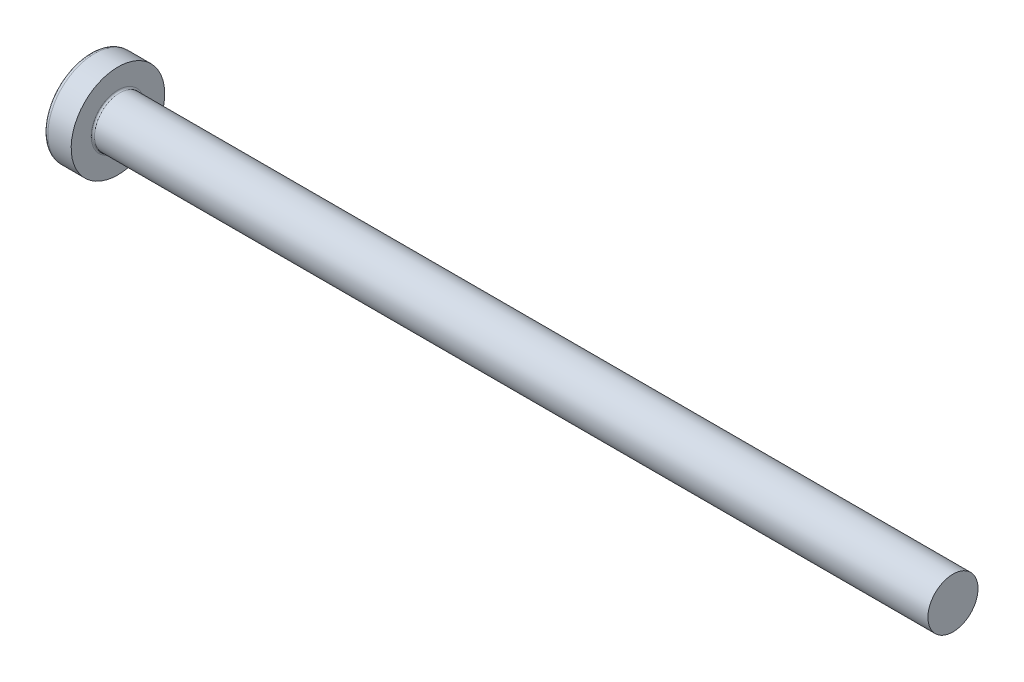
ISO-10303-21;
HEADER;
FILE_DESCRIPTION(('STEP AP214'),'2;1');
FILE_NAME('part.step','',(''),(''),'','','');
FILE_SCHEMA(('AUTOMOTIVE_DESIGN { 1 0 10303 214 1 1 1 1 }'));
ENDSEC;
DATA;
#1=APPLICATION_CONTEXT('core data for automotive mechanical design processes');
#2=APPLICATION_PROTOCOL_DEFINITION('international standard','automotive_design',2000,#1);
#3=PRODUCT_CONTEXT('',#1,'mechanical');
#4=PRODUCT('Part','Part','',(#3));
#5=PRODUCT_RELATED_PRODUCT_CATEGORY('part','',(#4));
#6=PRODUCT_DEFINITION_FORMATION('','',#4);
#7=PRODUCT_DEFINITION_CONTEXT('part definition',#1,'design');
#8=PRODUCT_DEFINITION('design','',#6,#7);
#9=PRODUCT_DEFINITION_SHAPE('','',#8);
#10=(LENGTH_UNIT() NAMED_UNIT(*) SI_UNIT(.MILLI.,.METRE.));
#11=(NAMED_UNIT(*) PLANE_ANGLE_UNIT() SI_UNIT($,.RADIAN.));
#12=(NAMED_UNIT(*) SI_UNIT($,.STERADIAN.) SOLID_ANGLE_UNIT());
#13=UNCERTAINTY_MEASURE_WITH_UNIT(LENGTH_MEASURE(1.E-05),#10,'distance_accuracy_value','');
#14=(GEOMETRIC_REPRESENTATION_CONTEXT(3) GLOBAL_UNCERTAINTY_ASSIGNED_CONTEXT((#13)) GLOBAL_UNIT_ASSIGNED_CONTEXT((#10,
#11,#12)) REPRESENTATION_CONTEXT('',''));
#15=CARTESIAN_POINT('',(0.,0.,0.));
#16=DIRECTION('',(0.,0.,1.));
#17=DIRECTION('',(1.,0.,0.));
#18=AXIS2_PLACEMENT_3D('',#15,#16,#17);
#19=CARTESIAN_POINT('',(1.75,0.527482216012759,-0.369999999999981));
#20=DIRECTION('',(0.,0.,1.));
#21=DIRECTION('',(1.,0.,0.));
#22=AXIS2_PLACEMENT_3D('',#19,#20,#21);
#23=PLANE('',#22);
#24=DIRECTION('',(0.,1.,0.));
#25=VECTOR('',#24,1.);
#26=CARTESIAN_POINT('',(1.75,0.527482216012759,-0.369999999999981));
#27=LINE('',#26,#25);
#28=CARTESIAN_POINT('',(1.75000000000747,0.415013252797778,-0.369999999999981));
#29=VERTEX_POINT('',#28);
#30=CARTESIAN_POINT('',(1.74999999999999,0.527482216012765,-0.369999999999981));
#31=VERTEX_POINT('',#30);
#32=EDGE_CURVE('E186',#29,#31,#27,.T.);
#33=ORIENTED_EDGE('',*,*,#32,.T.);
#34=DIRECTION('',(-0.89493436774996,0.446197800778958,0.));
#35=VECTOR('',#34,1.);
#36=CARTESIAN_POINT('',(1.75,0.527482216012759,-0.369999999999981));
#37=LINE('',#36,#35);
#38=CARTESIAN_POINT('',(0.187869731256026,1.30633161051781,-0.369999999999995));
#39=VERTEX_POINT('',#38);
#40=EDGE_CURVE('E169',#31,#39,#37,.T.);
#41=ORIENTED_EDGE('',*,*,#40,.T.);
#42=CARTESIAN_POINT('',(0.18786973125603,1.30633161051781,-0.369999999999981));
#43=CARTESIAN_POINT('',(0.154819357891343,1.18453176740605,-0.369999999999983));
#44=CARTESIAN_POINT('',(0.126454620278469,1.06183422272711,-0.369999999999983));
#45=CARTESIAN_POINT('',(0.0790964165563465,0.814643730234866,-0.36999999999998));
#46=CARTESIAN_POINT('',(0.0601029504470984,0.690150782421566,-0.369999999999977));
#47=CARTESIAN_POINT('',(0.0457951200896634,0.564760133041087,-0.369999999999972));
#48=B_SPLINE_CURVE_WITH_KNOTS('',3,(#42,#43,#44,#45,#46,#47),.UNSPECIFIED.,.F.,.F.,(4,2,4),(0.,
0.377800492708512,0.755600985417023),.UNSPECIFIED.);
#49=CARTESIAN_POINT('',(0.0457951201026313,0.564760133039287,-0.369999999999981));
#50=VERTEX_POINT('',#49);
#51=EDGE_CURVE('E178',#39,#50,#48,.T.);
#52=ORIENTED_EDGE('',*,*,#51,.T.);
#53=CARTESIAN_POINT('',(0.0457951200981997,0.564760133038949,-0.369999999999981));
#54=CARTESIAN_POINT('',(0.255445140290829,0.547215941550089,-0.369999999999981));
#55=CARTESIAN_POINT('',(0.465078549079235,0.529461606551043,-0.369999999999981));
#56=CARTESIAN_POINT('',(0.88428586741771,0.493290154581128,-0.369999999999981));
#57=CARTESIAN_POINT('',(1.09385977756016,0.474873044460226,-0.369999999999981));
#58=CARTESIAN_POINT('',(1.37783894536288,0.449298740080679,-0.369999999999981));
#59=CARTESIAN_POINT('',(1.45227978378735,0.442537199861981,-0.369999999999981));
#60=CARTESIAN_POINT('',(1.60114945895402,0.428880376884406,-0.369999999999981));
#61=CARTESIAN_POINT('',(1.67557829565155,0.421985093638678,-0.369999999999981));
#62=CARTESIAN_POINT('',(1.75000000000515,0.415013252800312,-0.369999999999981));
#63=B_SPLINE_CURVE_WITH_KNOTS('',3,(#53,#54,#55,#56,#57,#58,#59,#60,#61,#62),.UNSPECIFIED.,.F.,
.F.,(4,2,2,2,4),(0.,0.631149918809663,1.26229331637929,1.48653506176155,1.7107776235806),.UNSPECIFIED.);
#64=EDGE_CURVE('E536',#50,#29,#63,.T.);
#65=ORIENTED_EDGE('',*,*,#64,.T.);
#66=EDGE_LOOP('',(#33,#41,#52,#65));
#67=FACE_BOUND('',#66,.T.);
#68=ADVANCED_FACE('F17',(#67),#23,.T.);
#69=CARTESIAN_POINT('',(1.75,0.527482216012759,0.370000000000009));
#70=DIRECTION('',(0.446197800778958,0.89493436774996,0.));
#71=DIRECTION('',(-0.89493436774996,0.446197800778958,0.));
#72=AXIS2_PLACEMENT_3D('',#69,#70,#71);
#73=PLANE('',#72);
#74=DIRECTION('',(0.,0.,1.));
#75=VECTOR('',#74,1.);
#76=CARTESIAN_POINT('',(1.75,0.527482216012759,0.370000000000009));
#77=LINE('',#76,#75);
#78=CARTESIAN_POINT('',(1.75,0.527482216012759,0.370000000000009));
#79=VERTEX_POINT('',#78);
#80=CARTESIAN_POINT('',(1.74999999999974,0.527482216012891,0.175779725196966));
#81=VERTEX_POINT('',#80);
#82=EDGE_CURVE('E174',#79,#81,#77,.F.);
#83=ORIENTED_EDGE('',*,*,#82,.F.);
#84=DIRECTION('',(0.894934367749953,-0.446197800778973,0.));
#85=VECTOR('',#84,1.);
#86=CARTESIAN_POINT('',(0.187869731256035,1.30633161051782,0.370000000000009));
#87=LINE('',#86,#85);
#88=CARTESIAN_POINT('',(0.187869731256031,1.30633161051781,0.370000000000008));
#89=VERTEX_POINT('',#88);
#90=EDGE_CURVE('E171',#89,#79,#87,.T.);
#91=ORIENTED_EDGE('',*,*,#90,.F.);
#92=CARTESIAN_POINT('',(0.187869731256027,1.3063316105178,-0.370000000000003));
#93=CARTESIAN_POINT('',(0.179529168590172,1.31049006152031,-0.246666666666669));
#94=CARTESIAN_POINT('',(0.175358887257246,1.31256928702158,-0.123333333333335));
#95=CARTESIAN_POINT('',(0.175358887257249,1.31256928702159,0.123333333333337));
#96=CARTESIAN_POINT('',(0.179529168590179,1.31049006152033,0.246666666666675));
#97=CARTESIAN_POINT('',(0.187869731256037,1.30633161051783,0.370000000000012));
#98=B_SPLINE_CURVE_WITH_KNOTS('',3,(#92,#93,#94,#95,#96,#97),.UNSPECIFIED.,.F.,.F.,(4,2,4),(0.,
0.370264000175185,0.74052800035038),.UNSPECIFIED.);
#99=EDGE_CURVE('E163',#39,#89,#98,.T.);
#100=ORIENTED_EDGE('',*,*,#99,.F.);
#101=ORIENTED_EDGE('',*,*,#40,.F.);
#102=DIRECTION('',(0.,0.,1.));
#103=VECTOR('',#102,1.);
#104=CARTESIAN_POINT('',(1.74999999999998,0.527482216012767,0.370000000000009));
#105=LINE('',#104,#103);
#106=CARTESIAN_POINT('',(1.74999999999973,0.527482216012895,-0.175779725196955));
#107=VERTEX_POINT('',#106);
#108=EDGE_CURVE('E189',#107,#31,#105,.F.);
#109=ORIENTED_EDGE('',*,*,#108,.F.);
#110=CARTESIAN_POINT('',(2.66965234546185,0.0689604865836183,0.));
#111=DIRECTION('',(0.446197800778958,0.89493436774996,0.));
#112=DIRECTION('',(-0.89493436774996,0.446197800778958,0.));
#113=AXIS2_PLACEMENT_3D('',#110,#111,#112);
#114=ELLIPSE('',#113,1.10195891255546,0.486831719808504);
#115=EDGE_CURVE('E537',#81,#107,#114,.F.);
#116=ORIENTED_EDGE('',*,*,#115,.F.);
#117=EDGE_LOOP('',(#83,#91,#100,#101,#109,#116));
#118=FACE_BOUND('',#117,.T.);
#119=ADVANCED_FACE('F166',(#118),#73,.F.);
#120=CARTESIAN_POINT('',(0.0457951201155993,0.,0.));
#121=DIRECTION('',(-1.,0.,0.));
#122=DIRECTION('',(0.,-1.,0.));
#123=AXIS2_PLACEMENT_3D('',#120,#121,#122);
#124=CONICAL_SURFACE('',#123,0.675169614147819,0.0698131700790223);
#125=CARTESIAN_POINT('',(1.75000000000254,0.370000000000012,-0.415013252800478));
#126=CARTESIAN_POINT('',(1.57750313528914,0.370000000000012,-0.431158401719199));
#127=CARTESIAN_POINT('',(1.40497097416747,0.370000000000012,-0.446919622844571));
#128=CARTESIAN_POINT('',(1.05985338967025,0.370000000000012,-0.477835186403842));
#129=CARTESIAN_POINT('',(0.887267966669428,0.370000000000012,-0.492989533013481));
#130=CARTESIAN_POINT('',(0.603200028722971,0.370000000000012,-0.517563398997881));
#131=CARTESIAN_POINT('',(0.491728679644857,0.370000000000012,-0.527112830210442));
#132=CARTESIAN_POINT('',(0.268771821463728,0.370000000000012,-0.546050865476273));
#133=CARTESIAN_POINT('',(0.157286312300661,0.370000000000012,-0.555439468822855));
#134=CARTESIAN_POINT('',(0.0457951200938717,0.370000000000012,-0.564760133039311));
#135=B_SPLINE_CURVE_WITH_KNOTS('',3,(#125,#126,#127,#128,#129,#130,#131,#132,#133,#134),
.UNSPECIFIED.,.F.,.F.,(4,2,2,2,4),(0.,0.519751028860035,1.03949848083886,1.37513731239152,
1.71077761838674),.UNSPECIFIED.);
#136=CARTESIAN_POINT('',(1.75000000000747,0.370000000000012,-0.415013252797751));
#137=VERTEX_POINT('',#136);
#138=CARTESIAN_POINT('',(0.0457951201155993,0.370000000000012,-0.564760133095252));
#139=VERTEX_POINT('',#138);
#140=EDGE_CURVE('E524',#137,#139,#135,.T.);
#141=ORIENTED_EDGE('',*,*,#140,.F.);
#142=CARTESIAN_POINT('',(1.75000000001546,0.,0.));
#143=DIRECTION('',(-1.,0.,0.));
#144=DIRECTION('',(0.,0.,1.));
#145=AXIS2_PLACEMENT_3D('',#142,#143,#144);
#146=CIRCLE('',#145,0.555999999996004);
#147=EDGE_CURVE('E535',#29,#137,#146,.T.);
#148=ORIENTED_EDGE('',*,*,#147,.F.);
#149=ORIENTED_EDGE('',*,*,#64,.F.);
#150=CARTESIAN_POINT('',(0.0457951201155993,0.,0.));
#151=DIRECTION('',(-1.,0.,0.));
#152=DIRECTION('',(0.,-1.,0.));
#153=AXIS2_PLACEMENT_3D('',#150,#151,#152);
#154=CIRCLE('',#153,0.675169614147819);
#155=EDGE_CURVE('E182',#139,#50,#154,.F.);
#156=ORIENTED_EDGE('',*,*,#155,.F.);
#157=EDGE_LOOP('',(#141,#148,#149,#156));
#158=FACE_BOUND('',#157,.T.);
#159=ADVANCED_FACE('F559',(#158),#124,.F.);
#160=CARTESIAN_POINT('',(1.75,-0.527482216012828,0.370000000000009));
#161=DIRECTION('',(0.,0.,-1.));
#162=DIRECTION('',(-1.,0.,0.));
#163=AXIS2_PLACEMENT_3D('',#160,#161,#162);
#164=PLANE('',#163);
#165=CARTESIAN_POINT('',(0.0457951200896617,0.564760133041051,0.370000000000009));
#166=CARTESIAN_POINT('',(0.0601029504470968,0.690150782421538,0.370000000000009));
#167=CARTESIAN_POINT('',(0.0790964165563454,0.814643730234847,0.370000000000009));
#168=CARTESIAN_POINT('',(0.12645462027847,1.06183422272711,0.370000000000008));
#169=CARTESIAN_POINT('',(0.154819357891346,1.18453176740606,0.370000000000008));
#170=CARTESIAN_POINT('',(0.187869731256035,1.30633161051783,0.370000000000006));
#171=B_SPLINE_CURVE_WITH_KNOTS('',3,(#165,#166,#167,#168,#169,#170),.UNSPECIFIED.,.F.,.F.,(4,2,
4),(0.,0.377800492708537,0.755600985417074),.UNSPECIFIED.);
#172=CARTESIAN_POINT('',(0.0457951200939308,0.564760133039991,0.370000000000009));
#173=VERTEX_POINT('',#172);
#174=EDGE_CURVE('E528',#173,#89,#171,.T.);
#175=ORIENTED_EDGE('',*,*,#174,.T.);
#176=ORIENTED_EDGE('',*,*,#90,.T.);
#177=DIRECTION('',(0.,1.,0.));
#178=VECTOR('',#177,1.);
#179=CARTESIAN_POINT('',(1.75,-0.527482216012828,0.370000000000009));
#180=LINE('',#179,#178);
#181=CARTESIAN_POINT('',(1.75000000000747,0.415013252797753,0.370000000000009));
#182=VERTEX_POINT('',#181);
#183=EDGE_CURVE('E531',#79,#182,#180,.F.);
#184=ORIENTED_EDGE('',*,*,#183,.T.);
#185=CARTESIAN_POINT('',(1.75000000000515,0.415013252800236,0.370000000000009));
#186=CARTESIAN_POINT('',(1.57750313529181,0.431158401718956,0.370000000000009));
#187=CARTESIAN_POINT('',(1.40497097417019,0.446919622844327,0.370000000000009));
#188=CARTESIAN_POINT('',(1.05985338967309,0.477835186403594,0.370000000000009));
#189=CARTESIAN_POINT('',(0.887267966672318,0.492989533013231,0.370000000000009));
#190=CARTESIAN_POINT('',(0.603200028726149,0.517563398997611,0.370000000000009));
#191=CARTESIAN_POINT('',(0.491728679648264,0.527112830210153,0.370000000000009));
#192=CARTESIAN_POINT('',(0.268771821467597,0.546050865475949,0.370000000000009));
#193=CARTESIAN_POINT('',(0.157286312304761,0.555439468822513,0.370000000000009));
#194=CARTESIAN_POINT('',(0.0457951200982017,0.564760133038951,0.370000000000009));
#195=B_SPLINE_CURVE_WITH_KNOTS('',3,(#185,#186,#187,#188,#189,#190,#191,#192,#193,#194),
.UNSPECIFIED.,.F.,.F.,(4,2,2,2,4),(0.,0.519751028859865,1.03949848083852,1.37513731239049,
1.71077761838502),.UNSPECIFIED.);
#196=EDGE_CURVE('E600',#182,#173,#195,.T.);
#197=ORIENTED_EDGE('',*,*,#196,.T.);
#198=EDGE_LOOP('',(#175,#176,#184,#197));
#199=FACE_BOUND('',#198,.T.);
#200=ADVANCED_FACE('F563',(#199),#164,.T.);
#201=CARTESIAN_POINT('',(1.75,0.370000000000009,0.527482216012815));
#202=DIRECTION('',(0.,-1.,0.));
#203=DIRECTION('',(0.,0.,-1.));
#204=AXIS2_PLACEMENT_3D('',#201,#202,#203);
#205=PLANE('',#204);
#206=CARTESIAN_POINT('',(5.,0.370000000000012,0.));
#207=DIRECTION('',(0.,1.,0.));
#208=DIRECTION('',(0.,0.,1.));
#209=AXIS2_PLACEMENT_3D('',#206,#207,#208);
#210=CIRCLE('',#209,4.98629120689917);
#211=CARTESIAN_POINT('',(0.187869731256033,0.370000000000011,-1.30633161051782));
#212=VERTEX_POINT('',#211);
#213=EDGE_CURVE('E575',#139,#212,#210,.F.);
#214=ORIENTED_EDGE('',*,*,#213,.T.);
#215=DIRECTION('',(-0.89493436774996,0.,-0.446197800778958));
#216=VECTOR('',#215,1.);
#217=CARTESIAN_POINT('',(0.,0.370000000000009,-1.39999999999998));
#218=LINE('',#217,#216);
#219=CARTESIAN_POINT('',(1.75,0.369999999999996,-0.527482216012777));
#220=VERTEX_POINT('',#219);
#221=EDGE_CURVE('E506',#212,#220,#218,.F.);
#222=ORIENTED_EDGE('',*,*,#221,.T.);
#223=DIRECTION('',(0.,0.,-1.));
#224=VECTOR('',#223,1.);
#225=CARTESIAN_POINT('',(1.75,0.370000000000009,0.527482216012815));
#226=LINE('',#225,#224);
#227=EDGE_CURVE('E521',#220,#137,#226,.F.);
#228=ORIENTED_EDGE('',*,*,#227,.T.);
#229=ORIENTED_EDGE('',*,*,#140,.T.);
#230=EDGE_LOOP('',(#214,#222,#228,#229));
#231=FACE_BOUND('',#230,.T.);
#232=ADVANCED_FACE('F580',(#231),#205,.T.);
#233=CARTESIAN_POINT('',(0.0457951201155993,0.,0.));
#234=DIRECTION('',(-1.,0.,0.));
#235=DIRECTION('',(0.,-1.,0.));
#236=AXIS2_PLACEMENT_3D('',#233,#234,#235);
#237=CONICAL_SURFACE('',#236,0.675169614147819,0.0698131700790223);
#238=CARTESIAN_POINT('',(0.0457951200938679,0.370000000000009,0.564760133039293));
#239=CARTESIAN_POINT('',(0.255445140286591,0.370000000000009,0.547215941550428));
#240=CARTESIAN_POINT('',(0.465078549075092,0.370000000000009,0.529461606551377));
#241=CARTESIAN_POINT('',(0.884285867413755,0.370000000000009,0.493290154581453));
#242=CARTESIAN_POINT('',(1.0938597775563,0.370000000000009,0.474873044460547));
#243=CARTESIAN_POINT('',(1.37783894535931,0.370000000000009,0.449298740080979));
#244=CARTESIAN_POINT('',(1.45227978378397,0.370000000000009,0.442537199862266));
#245=CARTESIAN_POINT('',(1.60114945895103,0.37000000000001,0.428880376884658));
#246=CARTESIAN_POINT('',(1.67557829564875,0.37000000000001,0.421985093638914));
#247=CARTESIAN_POINT('',(1.75000000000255,0.37000000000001,0.415013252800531));
#248=B_SPLINE_CURVE_WITH_KNOTS('',3,(#238,#239,#240,#241,#242,#243,#244,#245,#246,#247),
.UNSPECIFIED.,.F.,.F.,(4,2,2,2,4),(0.,0.631149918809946,1.26229331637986,1.4865350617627,
1.71077762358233),.UNSPECIFIED.);
#249=CARTESIAN_POINT('',(0.0457951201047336,0.370000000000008,0.564760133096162));
#250=VERTEX_POINT('',#249);
#251=CARTESIAN_POINT('',(1.75000000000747,0.370000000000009,0.415013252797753));
#252=VERTEX_POINT('',#251);
#253=EDGE_CURVE('E503',#250,#252,#248,.T.);
#254=ORIENTED_EDGE('',*,*,#253,.F.);
#255=CARTESIAN_POINT('',(0.0457951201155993,0.,0.));
#256=DIRECTION('',(-1.,0.,0.));
#257=DIRECTION('',(0.,-1.,0.));
#258=AXIS2_PLACEMENT_3D('',#255,#256,#257);
#259=CIRCLE('',#258,0.675169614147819);
#260=EDGE_CURVE('E520',#173,#250,#259,.F.);
#261=ORIENTED_EDGE('',*,*,#260,.F.);
#262=ORIENTED_EDGE('',*,*,#196,.F.);
#263=CARTESIAN_POINT('',(1.75000000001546,0.,0.));
#264=DIRECTION('',(-1.,0.,0.));
#265=DIRECTION('',(0.,0.,1.));
#266=AXIS2_PLACEMENT_3D('',#263,#264,#265);
#267=CIRCLE('',#266,0.555999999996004);
#268=EDGE_CURVE('E515',#252,#182,#267,.T.);
#269=ORIENTED_EDGE('',*,*,#268,.F.);
#270=EDGE_LOOP('',(#254,#261,#262,#269));
#271=FACE_BOUND('',#270,.T.);
#272=ADVANCED_FACE('F584',(#271),#237,.F.);
#273=CARTESIAN_POINT('',(0.,0.369999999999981,-1.39999999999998));
#274=DIRECTION('',(0.446197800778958,0.,-0.89493436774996));
#275=DIRECTION('',(-0.89493436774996,0.,-0.446197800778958));
#276=AXIS2_PLACEMENT_3D('',#273,#274,#275);
#277=PLANE('',#276);
#278=DIRECTION('',(0.,-1.,0.));
#279=VECTOR('',#278,1.);
#280=CARTESIAN_POINT('',(1.75,0.527482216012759,-0.527482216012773));
#281=LINE('',#280,#279);
#282=CARTESIAN_POINT('',(1.74999999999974,0.17577972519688,-0.527482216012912));
#283=VERTEX_POINT('',#282);
#284=EDGE_CURVE('E493',#220,#283,#281,.T.);
#285=ORIENTED_EDGE('',*,*,#284,.F.);
#286=ORIENTED_EDGE('',*,*,#221,.F.);
#287=CARTESIAN_POINT('',(0.187869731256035,-0.370000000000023,-1.30633161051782));
#288=CARTESIAN_POINT('',(0.179529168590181,-0.246666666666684,-1.31049006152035));
#289=CARTESIAN_POINT('',(0.175358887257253,-0.123333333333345,-1.31256928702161));
#290=CARTESIAN_POINT('',(0.175358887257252,0.123333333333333,-1.31256928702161));
#291=CARTESIAN_POINT('',(0.179529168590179,0.246666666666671,-1.31049006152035));
#292=CARTESIAN_POINT('',(0.187869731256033,0.37000000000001,-1.30633161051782));
#293=B_SPLINE_CURVE_WITH_KNOTS('',3,(#287,#288,#289,#290,#291,#292),.UNSPECIFIED.,.F.,.F.,(4,2,
4),(0.,0.370264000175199,0.740528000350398),.UNSPECIFIED.);
#294=CARTESIAN_POINT('',(0.187869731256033,-0.37000000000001,-1.30633161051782));
#295=VERTEX_POINT('',#294);
#296=EDGE_CURVE('E510',#295,#212,#293,.T.);
#297=ORIENTED_EDGE('',*,*,#296,.F.);
#298=DIRECTION('',(-0.894934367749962,0.,-0.446197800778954));
#299=VECTOR('',#298,1.);
#300=CARTESIAN_POINT('',(1.75,-0.370000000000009,-0.527482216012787));
#301=LINE('',#300,#299);
#302=CARTESIAN_POINT('',(1.75,-0.370000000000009,-0.527482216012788));
#303=VERTEX_POINT('',#302);
#304=EDGE_CURVE('E482',#303,#295,#301,.T.);
#305=ORIENTED_EDGE('',*,*,#304,.F.);
#306=DIRECTION('',(0.,1.,0.));
#307=VECTOR('',#306,1.);
#308=CARTESIAN_POINT('',(1.75,0.369999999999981,-0.527482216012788));
#309=LINE('',#308,#307);
#310=CARTESIAN_POINT('',(1.74999999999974,-0.175779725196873,-0.527482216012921));
#311=VERTEX_POINT('',#310);
#312=EDGE_CURVE('E513',#311,#303,#309,.F.);
#313=ORIENTED_EDGE('',*,*,#312,.F.);
#314=CARTESIAN_POINT('',(2.66965234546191,0.,-0.0689604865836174));
#315=DIRECTION('',(0.446197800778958,0.,-0.89493436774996));
#316=DIRECTION('',(-0.89493436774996,0.,-0.446197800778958));
#317=AXIS2_PLACEMENT_3D('',#314,#315,#316);
#318=ELLIPSE('',#317,1.10195891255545,0.4868317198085);
#319=EDGE_CURVE('E509',#283,#311,#318,.F.);
#320=ORIENTED_EDGE('',*,*,#319,.F.);
#321=EDGE_LOOP('',(#285,#286,#297,#305,#313,#320));
#322=FACE_BOUND('',#321,.T.);
#323=ADVANCED_FACE('F589',(#322),#277,.F.);
#324=CARTESIAN_POINT('',(1.75,0.370000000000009,0.527482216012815));
#325=DIRECTION('',(0.,-1.,0.));
#326=DIRECTION('',(0.,0.,-1.));
#327=AXIS2_PLACEMENT_3D('',#324,#325,#326);
#328=PLANE('',#327);
#329=DIRECTION('',(0.,0.,1.));
#330=VECTOR('',#329,1.);
#331=CARTESIAN_POINT('',(1.75,0.370000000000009,-0.369999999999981));
#332=LINE('',#331,#330);
#333=CARTESIAN_POINT('',(1.75,0.370000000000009,0.527482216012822));
#334=VERTEX_POINT('',#333);
#335=EDGE_CURVE('E490',#334,#252,#332,.F.);
#336=ORIENTED_EDGE('',*,*,#335,.F.);
#337=DIRECTION('',(0.89493436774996,0.,-0.446197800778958));
#338=VECTOR('',#337,1.);
#339=CARTESIAN_POINT('',(1.75,0.370000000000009,0.527482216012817));
#340=LINE('',#339,#338);
#341=CARTESIAN_POINT('',(0.187869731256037,0.369999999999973,1.30633161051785));
#342=VERTEX_POINT('',#341);
#343=EDGE_CURVE('E473',#334,#342,#340,.F.);
#344=ORIENTED_EDGE('',*,*,#343,.T.);
#345=CARTESIAN_POINT('',(5.,0.370000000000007,0.));
#346=DIRECTION('',(0.,1.,0.));
#347=DIRECTION('',(0.,0.,1.));
#348=AXIS2_PLACEMENT_3D('',#345,#346,#347);
#349=CIRCLE('',#348,4.98629120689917);
#350=EDGE_CURVE('E611',#342,#250,#349,.F.);
#351=ORIENTED_EDGE('',*,*,#350,.T.);
#352=ORIENTED_EDGE('',*,*,#253,.T.);
#353=EDGE_LOOP('',(#336,#344,#351,#352));
#354=FACE_BOUND('',#353,.T.);
#355=ADVANCED_FACE('F616',(#354),#328,.T.);
#356=CARTESIAN_POINT('',(1.75,0.527482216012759,-0.369999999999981));
#357=DIRECTION('',(-1.,0.,0.));
#358=DIRECTION('',(0.,-1.,0.));
#359=AXIS2_PLACEMENT_3D('',#356,#357,#358);
#360=PLANE('',#359);
#361=CARTESIAN_POINT('',(1.74999999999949,0.,0.));
#362=DIRECTION('',(-1.,0.,0.));
#363=DIRECTION('',(0.,0.,1.));
#364=AXIS2_PLACEMENT_3D('',#361,#362,#363);
#365=CIRCLE('',#364,0.556000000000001);
#366=EDGE_CURVE('E457',#283,#137,#365,.F.);
#367=ORIENTED_EDGE('',*,*,#366,.T.);
#368=ORIENTED_EDGE('',*,*,#227,.F.);
#369=ORIENTED_EDGE('',*,*,#284,.T.);
#370=EDGE_LOOP('',(#367,#368,#369));
#371=FACE_BOUND('',#370,.T.);
#372=ADVANCED_FACE('F664',(#371),#360,.T.);
#373=CARTESIAN_POINT('',(1.75,0.527482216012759,-0.369999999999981));
#374=DIRECTION('',(-1.,0.,0.));
#375=DIRECTION('',(0.,-1.,0.));
#376=AXIS2_PLACEMENT_3D('',#373,#374,#375);
#377=PLANE('',#376);
#378=CARTESIAN_POINT('',(1.74999999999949,0.,0.));
#379=DIRECTION('',(-1.,0.,0.));
#380=DIRECTION('',(0.,0.,1.));
#381=AXIS2_PLACEMENT_3D('',#378,#379,#380);
#382=CIRCLE('',#381,0.556000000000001);
#383=EDGE_CURVE('E500',#29,#107,#382,.F.);
#384=ORIENTED_EDGE('',*,*,#383,.T.);
#385=ORIENTED_EDGE('',*,*,#108,.T.);
#386=ORIENTED_EDGE('',*,*,#32,.F.);
#387=EDGE_LOOP('',(#384,#385,#386));
#388=FACE_BOUND('',#387,.T.);
#389=ADVANCED_FACE('F661',(#388),#377,.T.);
#390=CARTESIAN_POINT('',(1.68306893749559,0.,0.));
#391=DIRECTION('',(-1.,0.,0.));
#392=DIRECTION('',(0.,0.,1.));
#393=AXIS2_PLACEMENT_3D('',#390,#391,#392);
#394=CONICAL_SURFACE('',#393,0.560680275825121,0.0698131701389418);
#395=CARTESIAN_POINT('',(1.74999999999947,0.,0.));
#396=DIRECTION('',(-1.,0.,0.));
#397=DIRECTION('',(0.,0.,1.));
#398=AXIS2_PLACEMENT_3D('',#395,#396,#397);
#399=CIRCLE('',#398,0.556000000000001);
#400=EDGE_CURVE('E496',#107,#81,#399,.F.);
#401=ORIENTED_EDGE('',*,*,#400,.T.);
#402=ORIENTED_EDGE('',*,*,#115,.T.);
#403=EDGE_LOOP('',(#401,#402));
#404=FACE_BOUND('',#403,.T.);
#405=ADVANCED_FACE('F658',(#404),#394,.F.);
#406=CARTESIAN_POINT('',(1.75,0.527482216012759,-0.369999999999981));
#407=DIRECTION('',(-1.,0.,0.));
#408=DIRECTION('',(0.,-1.,0.));
#409=AXIS2_PLACEMENT_3D('',#406,#407,#408);
#410=PLANE('',#409);
#411=CARTESIAN_POINT('',(1.74999999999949,0.,0.));
#412=DIRECTION('',(-1.,0.,0.));
#413=DIRECTION('',(0.,0.,1.));
#414=AXIS2_PLACEMENT_3D('',#411,#412,#413);
#415=CIRCLE('',#414,0.556000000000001);
#416=EDGE_CURVE('E499',#81,#182,#415,.F.);
#417=ORIENTED_EDGE('',*,*,#416,.T.);
#418=ORIENTED_EDGE('',*,*,#183,.F.);
#419=ORIENTED_EDGE('',*,*,#82,.T.);
#420=EDGE_LOOP('',(#417,#418,#419));
#421=FACE_BOUND('',#420,.T.);
#422=ADVANCED_FACE('F655',(#421),#410,.T.);
#423=CARTESIAN_POINT('',(1.75,0.527482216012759,-0.369999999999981));
#424=DIRECTION('',(-1.,0.,0.));
#425=DIRECTION('',(0.,-1.,0.));
#426=AXIS2_PLACEMENT_3D('',#423,#424,#425);
#427=PLANE('',#426);
#428=CARTESIAN_POINT('',(1.74999999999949,0.,0.));
#429=DIRECTION('',(-1.,0.,0.));
#430=DIRECTION('',(0.,0.,1.));
#431=AXIS2_PLACEMENT_3D('',#428,#429,#430);
#432=CIRCLE('',#431,0.556000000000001);
#433=CARTESIAN_POINT('',(1.74999999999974,0.17577972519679,0.527482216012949));
#434=VERTEX_POINT('',#433);
#435=EDGE_CURVE('E622',#252,#434,#432,.F.);
#436=ORIENTED_EDGE('',*,*,#435,.T.);
#437=DIRECTION('',(0.,1.,0.));
#438=VECTOR('',#437,1.);
#439=CARTESIAN_POINT('',(1.75,-0.370000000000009,0.527482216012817));
#440=LINE('',#439,#438);
#441=EDGE_CURVE('E477',#434,#334,#440,.T.);
#442=ORIENTED_EDGE('',*,*,#441,.T.);
#443=ORIENTED_EDGE('',*,*,#335,.T.);
#444=EDGE_LOOP('',(#436,#442,#443));
#445=FACE_BOUND('',#444,.T.);
#446=ADVANCED_FACE('F621',(#445),#427,.T.);
#447=CARTESIAN_POINT('',(1.75,-0.370000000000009,-0.527482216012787));
#448=DIRECTION('',(0.,1.,0.));
#449=DIRECTION('',(0.,0.,1.));
#450=AXIS2_PLACEMENT_3D('',#447,#448,#449);
#451=PLANE('',#450);
#452=DIRECTION('',(0.,0.,1.));
#453=VECTOR('',#452,1.);
#454=CARTESIAN_POINT('',(1.75,-0.370000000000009,-0.369999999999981));
#455=LINE('',#454,#453);
#456=CARTESIAN_POINT('',(1.75000000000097,-0.370000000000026,-0.415013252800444));
#457=VERTEX_POINT('',#456);
#458=EDGE_CURVE('E454',#303,#457,#455,.T.);
#459=ORIENTED_EDGE('',*,*,#458,.F.);
#460=ORIENTED_EDGE('',*,*,#304,.T.);
#461=CARTESIAN_POINT('',(5.,-0.370000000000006,0.));
#462=DIRECTION('',(0.,1.,0.));
#463=DIRECTION('',(0.,0.,1.));
#464=AXIS2_PLACEMENT_3D('',#461,#462,#463);
#465=CIRCLE('',#464,4.98629120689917);
#466=CARTESIAN_POINT('',(0.0457951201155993,-0.370000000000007,-0.564760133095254));
#467=VERTEX_POINT('',#466);
#468=EDGE_CURVE('E487',#295,#467,#465,.T.);
#469=ORIENTED_EDGE('',*,*,#468,.T.);
#470=CARTESIAN_POINT('',(0.0457951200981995,-0.370000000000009,-0.564760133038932));
#471=CARTESIAN_POINT('',(0.255445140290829,-0.370000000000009,-0.547215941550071));
#472=CARTESIAN_POINT('',(0.465078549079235,-0.370000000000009,-0.529461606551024));
#473=CARTESIAN_POINT('',(0.884285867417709,-0.370000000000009,-0.493290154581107));
#474=CARTESIAN_POINT('',(1.09385977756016,-0.370000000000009,-0.474873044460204));
#475=CARTESIAN_POINT('',(1.37783894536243,-0.370000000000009,-0.449298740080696));
#476=CARTESIAN_POINT('',(1.45227978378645,-0.370000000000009,-0.442537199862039));
#477=CARTESIAN_POINT('',(1.60114945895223,-0.37000000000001,-0.428880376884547));
#478=CARTESIAN_POINT('',(1.67557829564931,-0.37000000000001,-0.421985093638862));
#479=CARTESIAN_POINT('',(1.75000000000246,-0.37000000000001,-0.415013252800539));
#480=B_SPLINE_CURVE_WITH_KNOTS('',3,(#470,#471,#472,#473,#474,#475,#476,#477,#478,#479),
.UNSPECIFIED.,.F.,.F.,(4,2,2,2,4),(0.,0.631149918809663,1.26229331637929,1.4865350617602,
1.7107776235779),.UNSPECIFIED.);
#481=EDGE_CURVE('E286',#467,#457,#480,.T.);
#482=ORIENTED_EDGE('',*,*,#481,.T.);
#483=EDGE_LOOP('',(#459,#460,#469,#482));
#484=FACE_BOUND('',#483,.T.);
#485=ADVANCED_FACE('F646',(#484),#451,.T.);
#486=CARTESIAN_POINT('',(1.75,-0.370000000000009,0.527482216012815));
#487=DIRECTION('',(0.446197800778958,0.,0.89493436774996));
#488=DIRECTION('',(0.89493436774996,0.,-0.446197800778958));
#489=AXIS2_PLACEMENT_3D('',#486,#487,#488);
#490=PLANE('',#489);
#491=DIRECTION('',(0.,-1.,0.));
#492=VECTOR('',#491,1.);
#493=CARTESIAN_POINT('',(1.75,0.527482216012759,0.527482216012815));
#494=LINE('',#493,#492);
#495=CARTESIAN_POINT('',(1.75,-0.370000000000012,0.527482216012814));
#496=VERTEX_POINT('',#495);
#497=CARTESIAN_POINT('',(1.74999999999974,-0.175779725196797,0.527482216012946));
#498=VERTEX_POINT('',#497);
#499=EDGE_CURVE('E458',#496,#498,#494,.F.);
#500=ORIENTED_EDGE('',*,*,#499,.F.);
#501=DIRECTION('',(0.894934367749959,0.,-0.446197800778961));
#502=VECTOR('',#501,1.);
#503=CARTESIAN_POINT('',(0.187869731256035,-0.370000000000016,1.30633161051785));
#504=LINE('',#503,#502);
#505=CARTESIAN_POINT('',(0.187869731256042,-0.370000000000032,1.30633161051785));
#506=VERTEX_POINT('',#505);
#507=EDGE_CURVE('E438',#506,#496,#504,.T.);
#508=ORIENTED_EDGE('',*,*,#507,.F.);
#509=CARTESIAN_POINT('',(0.187869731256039,0.369999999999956,1.30633161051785));
#510=CARTESIAN_POINT('',(0.179529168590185,0.246666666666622,1.31049006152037));
#511=CARTESIAN_POINT('',(0.175358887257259,0.123333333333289,1.31256928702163));
#512=CARTESIAN_POINT('',(0.17535888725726,-0.123333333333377,1.31256928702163));
#513=CARTESIAN_POINT('',(0.179529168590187,-0.246666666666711,1.31049006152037));
#514=CARTESIAN_POINT('',(0.187869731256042,-0.370000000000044,1.30633161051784));
#515=B_SPLINE_CURVE_WITH_KNOTS('',3,(#509,#510,#511,#512,#513,#514),.UNSPECIFIED.,.F.,.F.,(4,2,
4),(0.,0.370264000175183,0.740528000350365),.UNSPECIFIED.);
#516=EDGE_CURVE('E476',#342,#506,#515,.T.);
#517=ORIENTED_EDGE('',*,*,#516,.F.);
#518=ORIENTED_EDGE('',*,*,#343,.F.);
#519=ORIENTED_EDGE('',*,*,#441,.F.);
#520=CARTESIAN_POINT('',(2.66965234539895,0.,0.0689604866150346));
#521=DIRECTION('',(0.446197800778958,0.,0.89493436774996));
#522=DIRECTION('',(-0.89493436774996,0.,0.446197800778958));
#523=AXIS2_PLACEMENT_3D('',#520,#521,#522);
#524=ELLIPSE('',#523,1.10195891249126,0.486831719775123);
#525=EDGE_CURVE('E466',#434,#498,#524,.T.);
#526=ORIENTED_EDGE('',*,*,#525,.T.);
#527=EDGE_LOOP('',(#500,#508,#517,#518,#519,#526));
#528=FACE_BOUND('',#527,.T.);
#529=ADVANCED_FACE('F641',(#528),#490,.F.);
#530=CARTESIAN_POINT('',(1.68307227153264,0.,0.));
#531=DIRECTION('',(-1.,0.,0.));
#532=DIRECTION('',(0.,0.,1.));
#533=AXIS2_PLACEMENT_3D('',#530,#531,#532);
#534=CONICAL_SURFACE('',#533,0.560680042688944,0.0698131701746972);
#535=CARTESIAN_POINT('',(1.74999999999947,0.,0.));
#536=DIRECTION('',(-1.,0.,0.));
#537=DIRECTION('',(0.,0.,1.));
#538=AXIS2_PLACEMENT_3D('',#535,#536,#537);
#539=CIRCLE('',#538,0.556000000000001);
#540=EDGE_CURVE('E441',#434,#498,#539,.F.);
#541=ORIENTED_EDGE('',*,*,#540,.T.);
#542=ORIENTED_EDGE('',*,*,#525,.F.);
#543=EDGE_LOOP('',(#541,#542));
#544=FACE_BOUND('',#543,.T.);
#545=ADVANCED_FACE('F645',(#544),#534,.F.);
#546=CARTESIAN_POINT('',(1.75,0.527482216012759,-0.369999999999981));
#547=DIRECTION('',(-1.,0.,0.));
#548=DIRECTION('',(0.,-1.,0.));
#549=AXIS2_PLACEMENT_3D('',#546,#547,#548);
#550=PLANE('',#549);
#551=CARTESIAN_POINT('',(1.74999999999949,0.,0.));
#552=DIRECTION('',(-1.,0.,0.));
#553=DIRECTION('',(0.,0.,1.));
#554=AXIS2_PLACEMENT_3D('',#551,#552,#553);
#555=CIRCLE('',#554,0.556000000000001);
#556=CARTESIAN_POINT('',(1.75000000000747,-0.370000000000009,0.415013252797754));
#557=VERTEX_POINT('',#556);
#558=EDGE_CURVE('E453',#498,#557,#555,.F.);
#559=ORIENTED_EDGE('',*,*,#558,.T.);
#560=DIRECTION('',(0.,0.,1.));
#561=VECTOR('',#560,1.);
#562=CARTESIAN_POINT('',(1.75,-0.370000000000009,-0.527482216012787));
#563=LINE('',#562,#561);
#564=EDGE_CURVE('E445',#496,#557,#563,.F.);
#565=ORIENTED_EDGE('',*,*,#564,.F.);
#566=ORIENTED_EDGE('',*,*,#499,.T.);
#567=EDGE_LOOP('',(#559,#565,#566));
#568=FACE_BOUND('',#567,.T.);
#569=ADVANCED_FACE('F717',(#568),#550,.T.);
#570=CARTESIAN_POINT('',(1.75,0.527482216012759,-0.369999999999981));
#571=DIRECTION('',(-1.,0.,0.));
#572=DIRECTION('',(0.,-1.,0.));
#573=AXIS2_PLACEMENT_3D('',#570,#571,#572);
#574=PLANE('',#573);
#575=CARTESIAN_POINT('',(1.74999999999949,0.,0.));
#576=DIRECTION('',(-1.,0.,0.));
#577=DIRECTION('',(0.,0.,1.));
#578=AXIS2_PLACEMENT_3D('',#575,#576,#577);
#579=CIRCLE('',#578,0.556000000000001);
#580=EDGE_CURVE('E305',#457,#311,#579,.F.);
#581=ORIENTED_EDGE('',*,*,#580,.T.);
#582=ORIENTED_EDGE('',*,*,#312,.T.);
#583=ORIENTED_EDGE('',*,*,#458,.T.);
#584=EDGE_LOOP('',(#581,#582,#583));
#585=FACE_BOUND('',#584,.T.);
#586=ADVANCED_FACE('F693',(#585),#574,.T.);
#587=CARTESIAN_POINT('',(1.68306893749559,0.,0.));
#588=DIRECTION('',(-1.,0.,0.));
#589=DIRECTION('',(0.,0.,1.));
#590=AXIS2_PLACEMENT_3D('',#587,#588,#589);
#591=CONICAL_SURFACE('',#590,0.560680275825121,0.0698131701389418);
#592=CARTESIAN_POINT('',(1.74999999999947,0.,0.));
#593=DIRECTION('',(-1.,0.,0.));
#594=DIRECTION('',(0.,0.,1.));
#595=AXIS2_PLACEMENT_3D('',#592,#593,#594);
#596=CIRCLE('',#595,0.556000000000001);
#597=EDGE_CURVE('E301',#311,#283,#596,.F.);
#598=ORIENTED_EDGE('',*,*,#597,.T.);
#599=ORIENTED_EDGE('',*,*,#319,.T.);
#600=EDGE_LOOP('',(#598,#599));
#601=FACE_BOUND('',#600,.T.);
#602=ADVANCED_FACE('F281',(#601),#591,.F.);
#603=CARTESIAN_POINT('',(0.0457951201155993,0.,0.));
#604=DIRECTION('',(-1.,0.,0.));
#605=DIRECTION('',(0.,-1.,0.));
#606=AXIS2_PLACEMENT_3D('',#603,#604,#605);
#607=CONICAL_SURFACE('',#606,0.675169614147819,0.0698131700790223);
#608=ORIENTED_EDGE('',*,*,#481,.F.);
#609=CARTESIAN_POINT('',(0.0457951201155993,0.,0.));
#610=DIRECTION('',(-1.,0.,0.));
#611=DIRECTION('',(0.,-1.,0.));
#612=AXIS2_PLACEMENT_3D('',#609,#610,#611);
#613=CIRCLE('',#612,0.675169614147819);
#614=CARTESIAN_POINT('',(0.0457951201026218,-0.564760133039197,-0.369999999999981));
#615=VERTEX_POINT('',#614);
#616=EDGE_CURVE('E628',#615,#467,#613,.F.);
#617=ORIENTED_EDGE('',*,*,#616,.F.);
#618=CARTESIAN_POINT('',(1.74999999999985,-0.415013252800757,-0.369999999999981));
#619=CARTESIAN_POINT('',(1.5775031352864,-0.431158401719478,-0.369999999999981));
#620=CARTESIAN_POINT('',(1.40497097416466,-0.446919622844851,-0.369999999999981));
#621=CARTESIAN_POINT('',(1.05985338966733,-0.477835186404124,-0.369999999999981));
#622=CARTESIAN_POINT('',(0.887267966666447,-0.492989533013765,-0.369999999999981));
#623=CARTESIAN_POINT('',(0.603200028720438,-0.517563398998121,-0.369999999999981));
#624=CARTESIAN_POINT('',(0.49172867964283,-0.527112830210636,-0.369999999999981));
#625=CARTESIAN_POINT('',(0.268771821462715,-0.546050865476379,-0.369999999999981));
#626=CARTESIAN_POINT('',(0.157286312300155,-0.555439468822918,-0.369999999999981));
#627=CARTESIAN_POINT('',(0.0457951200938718,-0.564760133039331,-0.369999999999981));
#628=B_SPLINE_CURVE_WITH_KNOTS('',3,(#618,#619,#620,#621,#622,#623,#624,#625,#626,#627),
.UNSPECIFIED.,.F.,.F.,(4,2,2,2,4),(0.,0.519751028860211,1.03949848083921,1.37513731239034,
1.71077761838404),.UNSPECIFIED.);
#629=CARTESIAN_POINT('',(1.74999999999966,-0.415013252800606,-0.369999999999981));
#630=VERTEX_POINT('',#629);
#631=EDGE_CURVE('E294',#630,#615,#628,.T.);
#632=ORIENTED_EDGE('',*,*,#631,.F.);
#633=CARTESIAN_POINT('',(1.74999999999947,0.,0.));
#634=DIRECTION('',(-1.,0.,0.));
#635=DIRECTION('',(0.,0.,1.));
#636=AXIS2_PLACEMENT_3D('',#633,#634,#635);
#637=CIRCLE('',#636,0.556000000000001);
#638=EDGE_CURVE('E450',#630,#457,#637,.F.);
#639=ORIENTED_EDGE('',*,*,#638,.T.);
#640=EDGE_LOOP('',(#608,#617,#632,#639));
#641=FACE_BOUND('',#640,.T.);
#642=ADVANCED_FACE('F275',(#641),#607,.F.);
#643=CARTESIAN_POINT('',(1.75,-0.370000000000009,-0.527482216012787));
#644=DIRECTION('',(0.,1.,0.));
#645=DIRECTION('',(0.,0.,1.));
#646=AXIS2_PLACEMENT_3D('',#643,#644,#645);
#647=PLANE('',#646);
#648=CARTESIAN_POINT('',(5.,-0.370000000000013,0.));
#649=DIRECTION('',(0.,1.,0.));
#650=DIRECTION('',(0.,0.,1.));
#651=AXIS2_PLACEMENT_3D('',#648,#649,#650);
#652=CIRCLE('',#651,4.98629120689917);
#653=CARTESIAN_POINT('',(0.045795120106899,-0.370000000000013,0.564760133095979));
#654=VERTEX_POINT('',#653);
#655=EDGE_CURVE('E442',#654,#506,#652,.T.);
#656=ORIENTED_EDGE('',*,*,#655,.T.);
#657=ORIENTED_EDGE('',*,*,#507,.T.);
#658=ORIENTED_EDGE('',*,*,#564,.T.);
#659=CARTESIAN_POINT('',(1.75000000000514,-0.370000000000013,0.415013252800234));
#660=CARTESIAN_POINT('',(1.5775031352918,-0.370000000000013,0.431158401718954));
#661=CARTESIAN_POINT('',(1.40497097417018,-0.370000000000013,0.446919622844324));
#662=CARTESIAN_POINT('',(1.05985338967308,-0.370000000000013,0.477835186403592));
#663=CARTESIAN_POINT('',(0.887267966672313,-0.370000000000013,0.492989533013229));
#664=CARTESIAN_POINT('',(0.603200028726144,-0.370000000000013,0.517563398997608));
#665=CARTESIAN_POINT('',(0.49172867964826,-0.370000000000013,0.52711283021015));
#666=CARTESIAN_POINT('',(0.268771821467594,-0.370000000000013,0.546050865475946));
#667=CARTESIAN_POINT('',(0.157286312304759,-0.370000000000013,0.555439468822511));
#668=CARTESIAN_POINT('',(0.0457951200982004,-0.370000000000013,0.564760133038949));
#669=B_SPLINE_CURVE_WITH_KNOTS('',3,(#659,#660,#661,#662,#663,#664,#665,#666,#667,#668),
.UNSPECIFIED.,.F.,.F.,(4,2,2,2,4),(0.,0.519751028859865,1.03949848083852,1.37513731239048,
1.71077761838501),.UNSPECIFIED.);
#670=EDGE_CURVE('E256',#557,#654,#669,.T.);
#671=ORIENTED_EDGE('',*,*,#670,.T.);
#672=EDGE_LOOP('',(#656,#657,#658,#671));
#673=FACE_BOUND('',#672,.T.);
#674=ADVANCED_FACE('F269',(#673),#647,.T.);
#675=CARTESIAN_POINT('',(1.74999999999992,0.,0.));
#676=DIRECTION('',(-1.,0.,0.));
#677=DIRECTION('',(0.,0.,1.));
#678=AXIS2_PLACEMENT_3D('',#675,#676,#677);
#679=CONICAL_SURFACE('',#678,0.555999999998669,1.25663706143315);
#680=CARTESIAN_POINT('',(1.93065535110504,0.,0.));
#681=VERTEX_POINT('',#680);
#682=VERTEX_LOOP('',#681);
#683=FACE_BOUND('',#682,.T.);
#684=ORIENTED_EDGE('',*,*,#366,.F.);
#685=ORIENTED_EDGE('',*,*,#597,.F.);
#686=ORIENTED_EDGE('',*,*,#580,.F.);
#687=ORIENTED_EDGE('',*,*,#638,.F.);
#688=CARTESIAN_POINT('',(1.74999999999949,0.,0.));
#689=DIRECTION('',(-1.,0.,0.));
#690=DIRECTION('',(0.,0.,1.));
#691=AXIS2_PLACEMENT_3D('',#688,#689,#690);
#692=CIRCLE('',#691,0.556000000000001);
#693=CARTESIAN_POINT('',(1.75000000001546,-0.527482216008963,-0.175779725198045));
#694=VERTEX_POINT('',#693);
#695=EDGE_CURVE('E264',#694,#630,#692,.F.);
#696=ORIENTED_EDGE('',*,*,#695,.F.);
#697=CARTESIAN_POINT('',(1.75000000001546,0.,0.));
#698=DIRECTION('',(-1.,0.,0.));
#699=DIRECTION('',(0.,0.,1.));
#700=AXIS2_PLACEMENT_3D('',#697,#698,#699);
#701=CIRCLE('',#700,0.555999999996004);
#702=CARTESIAN_POINT('',(1.75000000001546,-0.527482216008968,0.175779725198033));
#703=VERTEX_POINT('',#702);
#704=EDGE_CURVE('E420',#694,#703,#701,.T.);
#705=ORIENTED_EDGE('',*,*,#704,.T.);
#706=CARTESIAN_POINT('',(1.74999999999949,0.,0.));
#707=DIRECTION('',(-1.,0.,0.));
#708=DIRECTION('',(0.,0.,1.));
#709=AXIS2_PLACEMENT_3D('',#706,#707,#708);
#710=CIRCLE('',#709,0.556000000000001);
#711=CARTESIAN_POINT('',(1.75000000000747,-0.415013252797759,0.370000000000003));
#712=VERTEX_POINT('',#711);
#713=EDGE_CURVE('E251',#712,#703,#710,.F.);
#714=ORIENTED_EDGE('',*,*,#713,.F.);
#715=CARTESIAN_POINT('',(1.75000000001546,0.,0.));
#716=DIRECTION('',(-1.,0.,0.));
#717=DIRECTION('',(0.,0.,1.));
#718=AXIS2_PLACEMENT_3D('',#715,#716,#717);
#719=CIRCLE('',#718,0.555999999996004);
#720=EDGE_CURVE('E263',#712,#557,#719,.T.);
#721=ORIENTED_EDGE('',*,*,#720,.T.);
#722=ORIENTED_EDGE('',*,*,#558,.F.);
#723=ORIENTED_EDGE('',*,*,#540,.F.);
#724=ORIENTED_EDGE('',*,*,#435,.F.);
#725=ORIENTED_EDGE('',*,*,#268,.T.);
#726=ORIENTED_EDGE('',*,*,#416,.F.);
#727=ORIENTED_EDGE('',*,*,#400,.F.);
#728=ORIENTED_EDGE('',*,*,#383,.F.);
#729=ORIENTED_EDGE('',*,*,#147,.T.);
#730=EDGE_LOOP('',(#684,#685,#686,#687,#696,#705,#714,#721,#722,#723,#724,#725,#726,#727,#728,#729));
#731=FACE_BOUND('',#730,.T.);
#732=ADVANCED_FACE('F274',(#683,#731),#679,.F.);
#733=CARTESIAN_POINT('',(1.75,0.527482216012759,-0.369999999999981));
#734=DIRECTION('',(0.,0.,1.));
#735=DIRECTION('',(1.,0.,0.));
#736=AXIS2_PLACEMENT_3D('',#733,#734,#735);
#737=PLANE('',#736);
#738=CARTESIAN_POINT('',(0.0457951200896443,-0.564760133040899,-0.36999999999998));
#739=CARTESIAN_POINT('',(0.0601029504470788,-0.690150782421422,-0.369999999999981));
#740=CARTESIAN_POINT('',(0.0790964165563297,-0.814643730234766,-0.369999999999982));
#741=CARTESIAN_POINT('',(0.126454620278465,-1.06183422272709,-0.369999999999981));
#742=CARTESIAN_POINT('',(0.154819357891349,-1.18453176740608,-0.36999999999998));
#743=CARTESIAN_POINT('',(0.187869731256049,-1.30633161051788,-0.369999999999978));
#744=B_SPLINE_CURVE_WITH_KNOTS('',3,(#738,#739,#740,#741,#742,#743),.UNSPECIFIED.,.F.,.F.,(4,2,
4),(0.,0.377800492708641,0.755600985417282),.UNSPECIFIED.);
#745=CARTESIAN_POINT('',(0.187869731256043,-1.30633161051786,-0.369999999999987));
#746=VERTEX_POINT('',#745);
#747=EDGE_CURVE('E300',#615,#746,#744,.T.);
#748=ORIENTED_EDGE('',*,*,#747,.T.);
#749=DIRECTION('',(0.89493436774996,0.446197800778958,0.));
#750=VECTOR('',#749,1.);
#751=CARTESIAN_POINT('',(0.,-1.40000000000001,-0.369999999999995));
#752=LINE('',#751,#750);
#753=CARTESIAN_POINT('',(1.75,-0.527482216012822,-0.369999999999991));
#754=VERTEX_POINT('',#753);
#755=EDGE_CURVE('E248',#746,#754,#752,.T.);
#756=ORIENTED_EDGE('',*,*,#755,.T.);
#757=DIRECTION('',(0.,-1.,0.));
#758=VECTOR('',#757,1.);
#759=CARTESIAN_POINT('',(1.75,0.527482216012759,-0.369999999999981));
#760=LINE('',#759,#758);
#761=EDGE_CURVE('E433',#630,#754,#760,.T.);
#762=ORIENTED_EDGE('',*,*,#761,.F.);
#763=ORIENTED_EDGE('',*,*,#631,.T.);
#764=EDGE_LOOP('',(#748,#756,#762,#763));
#765=FACE_BOUND('',#764,.T.);
#766=ADVANCED_FACE('F307',(#765),#737,.T.);
#767=CARTESIAN_POINT('',(1.75,0.527482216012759,-0.369999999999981));
#768=DIRECTION('',(-1.,0.,0.));
#769=DIRECTION('',(0.,-1.,0.));
#770=AXIS2_PLACEMENT_3D('',#767,#768,#769);
#771=PLANE('',#770);
#772=ORIENTED_EDGE('',*,*,#695,.T.);
#773=ORIENTED_EDGE('',*,*,#761,.T.);
#774=DIRECTION('',(0.,0.,1.));
#775=VECTOR('',#774,1.);
#776=CARTESIAN_POINT('',(1.75,-0.527482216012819,-0.369999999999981));
#777=LINE('',#776,#775);
#778=EDGE_CURVE('E422',#754,#694,#777,.T.);
#779=ORIENTED_EDGE('',*,*,#778,.T.);
#780=EDGE_LOOP('',(#772,#773,#779));
#781=FACE_BOUND('',#780,.T.);
#782=ADVANCED_FACE('F311',(#781),#771,.T.);
#783=CARTESIAN_POINT('',(1.68306893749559,0.,0.));
#784=DIRECTION('',(-1.,0.,0.));
#785=DIRECTION('',(0.,0.,1.));
#786=AXIS2_PLACEMENT_3D('',#783,#784,#785);
#787=CONICAL_SURFACE('',#786,0.560680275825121,0.0698131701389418);
#788=ORIENTED_EDGE('',*,*,#704,.F.);
#789=CARTESIAN_POINT('',(2.66965234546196,-0.0689604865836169,0.));
#790=DIRECTION('',(0.446197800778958,-0.89493436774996,0.));
#791=DIRECTION('',(-0.89493436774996,-0.446197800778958,0.));
#792=AXIS2_PLACEMENT_3D('',#789,#790,#791);
#793=ELLIPSE('',#792,1.10195891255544,0.486831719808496);
#794=EDGE_CURVE('E250',#694,#703,#793,.F.);
#795=ORIENTED_EDGE('',*,*,#794,.T.);
#796=EDGE_LOOP('',(#788,#795));
#797=FACE_BOUND('',#796,.T.);
#798=ADVANCED_FACE('F315',(#797),#787,.F.);
#799=CARTESIAN_POINT('',(0.0457951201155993,0.,0.));
#800=DIRECTION('',(-1.,0.,0.));
#801=DIRECTION('',(0.,-1.,0.));
#802=AXIS2_PLACEMENT_3D('',#799,#800,#801);
#803=CONICAL_SURFACE('',#802,0.675169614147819,0.0698131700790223);
#804=ORIENTED_EDGE('',*,*,#670,.F.);
#805=ORIENTED_EDGE('',*,*,#720,.F.);
#806=CARTESIAN_POINT('',(0.0457951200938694,-0.564760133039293,0.370000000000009));
#807=CARTESIAN_POINT('',(0.255445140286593,-0.547215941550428,0.370000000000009));
#808=CARTESIAN_POINT('',(0.465078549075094,-0.529461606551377,0.370000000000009));
#809=CARTESIAN_POINT('',(0.884285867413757,-0.493290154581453,0.370000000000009));
#810=CARTESIAN_POINT('',(1.0938597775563,-0.474873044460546,0.370000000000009));
#811=CARTESIAN_POINT('',(1.37783894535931,-0.449298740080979,0.370000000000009));
#812=CARTESIAN_POINT('',(1.45227978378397,-0.442537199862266,0.370000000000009));
#813=CARTESIAN_POINT('',(1.60114945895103,-0.428880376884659,0.370000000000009));
#814=CARTESIAN_POINT('',(1.67557829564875,-0.421985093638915,0.370000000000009));
#815=CARTESIAN_POINT('',(1.75000000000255,-0.415013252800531,0.370000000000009));
#816=B_SPLINE_CURVE_WITH_KNOTS('',3,(#806,#807,#808,#809,#810,#811,#812,#813,#814,#815),
.UNSPECIFIED.,.F.,.F.,(4,2,2,2,4),(0.,0.631149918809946,1.26229331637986,1.4865350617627,
1.71077762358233),.UNSPECIFIED.);
#817=CARTESIAN_POINT('',(0.0457951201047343,-0.564760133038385,0.370000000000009));
#818=VERTEX_POINT('',#817);
#819=EDGE_CURVE('E221',#818,#712,#816,.T.);
#820=ORIENTED_EDGE('',*,*,#819,.F.);
#821=CARTESIAN_POINT('',(0.0457951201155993,0.,0.));
#822=DIRECTION('',(-1.,0.,0.));
#823=DIRECTION('',(0.,-1.,0.));
#824=AXIS2_PLACEMENT_3D('',#821,#822,#823);
#825=CIRCLE('',#824,0.675169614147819);
#826=EDGE_CURVE('E254',#654,#818,#825,.F.);
#827=ORIENTED_EDGE('',*,*,#826,.F.);
#828=EDGE_LOOP('',(#804,#805,#820,#827));
#829=FACE_BOUND('',#828,.T.);
#830=ADVANCED_FACE('F266',(#829),#803,.F.);
#831=CARTESIAN_POINT('',(1.75,0.527482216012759,-0.369999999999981));
#832=DIRECTION('',(-1.,0.,0.));
#833=DIRECTION('',(0.,-1.,0.));
#834=AXIS2_PLACEMENT_3D('',#831,#832,#833);
#835=PLANE('',#834);
#836=ORIENTED_EDGE('',*,*,#713,.T.);
#837=DIRECTION('',(0.,0.,1.));
#838=VECTOR('',#837,1.);
#839=CARTESIAN_POINT('',(1.74999999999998,-0.527482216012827,-0.369999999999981));
#840=LINE('',#839,#838);
#841=CARTESIAN_POINT('',(1.74999999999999,-0.527482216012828,0.370000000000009));
#842=VERTEX_POINT('',#841);
#843=EDGE_CURVE('E249',#703,#842,#840,.T.);
#844=ORIENTED_EDGE('',*,*,#843,.T.);
#845=DIRECTION('',(0.,1.,0.));
#846=VECTOR('',#845,1.);
#847=CARTESIAN_POINT('',(1.75,-0.527482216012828,0.370000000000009));
#848=LINE('',#847,#846);
#849=EDGE_CURVE('E414',#712,#842,#848,.F.);
#850=ORIENTED_EDGE('',*,*,#849,.F.);
#851=EDGE_LOOP('',(#836,#844,#850));
#852=FACE_BOUND('',#851,.T.);
#853=ADVANCED_FACE('F240',(#852),#835,.T.);
#854=CARTESIAN_POINT('',(0.,-1.40000000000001,-0.369999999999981));
#855=DIRECTION('',(0.446197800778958,-0.89493436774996,0.));
#856=DIRECTION('',(0.89493436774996,0.446197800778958,0.));
#857=AXIS2_PLACEMENT_3D('',#854,#855,#856);
#858=PLANE('',#857);
#859=ORIENTED_EDGE('',*,*,#778,.F.);
#860=ORIENTED_EDGE('',*,*,#755,.F.);
#861=CARTESIAN_POINT('',(0.18786973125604,-1.30633161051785,0.370000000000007));
#862=CARTESIAN_POINT('',(0.179529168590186,-1.31049006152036,0.246666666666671));
#863=CARTESIAN_POINT('',(0.175358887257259,-1.31256928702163,0.123333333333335));
#864=CARTESIAN_POINT('',(0.175358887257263,-1.31256928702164,-0.123333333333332));
#865=CARTESIAN_POINT('',(0.179529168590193,-1.31049006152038,-0.246666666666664));
#866=CARTESIAN_POINT('',(0.187869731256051,-1.30633161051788,-0.369999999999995));
#867=B_SPLINE_CURVE_WITH_KNOTS('',3,(#861,#862,#863,#864,#865,#866),.UNSPECIFIED.,.F.,.F.,(4,2,
4),(0.,0.37026400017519,0.740528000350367),.UNSPECIFIED.);
#868=CARTESIAN_POINT('',(0.187869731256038,-1.30633161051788,0.370000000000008));
#869=VERTEX_POINT('',#868);
#870=EDGE_CURVE('E243',#869,#746,#867,.T.);
#871=ORIENTED_EDGE('',*,*,#870,.F.);
#872=DIRECTION('',(-0.89493436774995,-0.44619780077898,0.));
#873=VECTOR('',#872,1.);
#874=CARTESIAN_POINT('',(1.75,-0.527482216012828,0.370000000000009));
#875=LINE('',#874,#873);
#876=EDGE_CURVE('E220',#842,#869,#875,.T.);
#877=ORIENTED_EDGE('',*,*,#876,.F.);
#878=ORIENTED_EDGE('',*,*,#843,.F.);
#879=ORIENTED_EDGE('',*,*,#794,.F.);
#880=EDGE_LOOP('',(#859,#860,#871,#877,#878,#879));
#881=FACE_BOUND('',#880,.T.);
#882=ADVANCED_FACE('F234',(#881),#858,.F.);
#883=CARTESIAN_POINT('',(1.75,-0.527482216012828,0.370000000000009));
#884=DIRECTION('',(0.,0.,-1.));
#885=DIRECTION('',(-1.,0.,0.));
#886=AXIS2_PLACEMENT_3D('',#883,#884,#885);
#887=PLANE('',#886);
#888=ORIENTED_EDGE('',*,*,#849,.T.);
#889=ORIENTED_EDGE('',*,*,#876,.T.);
#890=CARTESIAN_POINT('',(0.0457951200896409,-0.564760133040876,0.370000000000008));
#891=CARTESIAN_POINT('',(0.0601029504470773,-0.690150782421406,0.370000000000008));
#892=CARTESIAN_POINT('',(0.07909641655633,-0.814643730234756,0.370000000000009));
#893=CARTESIAN_POINT('',(0.126454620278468,-1.0618342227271,0.370000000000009));
#894=CARTESIAN_POINT('',(0.154819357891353,-1.18453176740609,0.370000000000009));
#895=CARTESIAN_POINT('',(0.187869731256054,-1.3063316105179,0.370000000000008));
#896=B_SPLINE_CURVE_WITH_KNOTS('',3,(#890,#891,#892,#893,#894,#895),.UNSPECIFIED.,.F.,.F.,(4,2,
4),(0.,0.377800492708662,0.755600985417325),.UNSPECIFIED.);
#897=EDGE_CURVE('E213',#818,#869,#896,.T.);
#898=ORIENTED_EDGE('',*,*,#897,.F.);
#899=ORIENTED_EDGE('',*,*,#819,.T.);
#900=EDGE_LOOP('',(#888,#889,#898,#899));
#901=FACE_BOUND('',#900,.T.);
#902=ADVANCED_FACE('F230',(#901),#887,.T.);
#903=CARTESIAN_POINT('',(5.,0.,0.));
#904=DIRECTION('',(0.,1.,0.));
#905=DIRECTION('',(1.,0.,0.));
#906=AXIS2_PLACEMENT_3D('',#903,#904,#905);
#907=SPHERICAL_SURFACE('',#906,5.);
#908=CARTESIAN_POINT('',(0.775371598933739,0.,0.));
#909=DIRECTION('',(-1.,0.,0.));
#910=DIRECTION('',(0.,0.,1.));
#911=AXIS2_PLACEMENT_3D('',#908,#909,#910);
#912=CIRCLE('',#911,2.67441860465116);
#913=CARTESIAN_POINT('',(0.775371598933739,0.,2.67441860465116));
#914=VERTEX_POINT('',#913);
#915=EDGE_CURVE('E209',#914,#914,#912,.F.);
#916=ORIENTED_EDGE('',*,*,#915,.F.);
#917=EDGE_LOOP('',(#916));
#918=FACE_BOUND('',#917,.T.);
#919=ORIENTED_EDGE('',*,*,#897,.T.);
#920=ORIENTED_EDGE('',*,*,#870,.T.);
#921=ORIENTED_EDGE('',*,*,#747,.F.);
#922=ORIENTED_EDGE('',*,*,#616,.T.);
#923=ORIENTED_EDGE('',*,*,#468,.F.);
#924=ORIENTED_EDGE('',*,*,#296,.T.);
#925=ORIENTED_EDGE('',*,*,#213,.F.);
#926=ORIENTED_EDGE('',*,*,#155,.T.);
#927=ORIENTED_EDGE('',*,*,#51,.F.);
#928=ORIENTED_EDGE('',*,*,#99,.T.);
#929=ORIENTED_EDGE('',*,*,#174,.F.);
#930=ORIENTED_EDGE('',*,*,#260,.T.);
#931=ORIENTED_EDGE('',*,*,#350,.F.);
#932=ORIENTED_EDGE('',*,*,#516,.T.);
#933=ORIENTED_EDGE('',*,*,#655,.F.);
#934=ORIENTED_EDGE('',*,*,#826,.T.);
#935=EDGE_LOOP('',(#919,#920,#921,#922,#923,#924,#925,#926,#927,#928,#929,#930,#931,#932,#933,#934));
#936=FACE_BOUND('',#935,.T.);
#937=ADVANCED_FACE('F180',(#918,#936),#907,.T.);
#938=CARTESIAN_POINT('',(1.00350153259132,0.,0.));
#939=DIRECTION('',(-1.,0.,0.));
#940=DIRECTION('',(0.,0.,1.));
#941=AXIS2_PLACEMENT_3D('',#938,#939,#940);
#942=TOROIDAL_SURFACE('',#941,2.53,0.270000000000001);
#943=ORIENTED_EDGE('',*,*,#915,.T.);
#944=EDGE_LOOP('',(#943));
#945=FACE_BOUND('',#944,.T.);
#946=CARTESIAN_POINT('',(1.00350153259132,0.,0.));
#947=DIRECTION('',(-1.,0.,0.));
#948=DIRECTION('',(0.,-1.,0.));
#949=AXIS2_PLACEMENT_3D('',#946,#947,#948);
#950=CIRCLE('',#949,2.8);
#951=CARTESIAN_POINT('',(1.00350153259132,-2.8,0.));
#952=VERTEX_POINT('',#951);
#953=EDGE_CURVE('E212',#952,#952,#950,.F.);
#954=ORIENTED_EDGE('',*,*,#953,.F.);
#955=EDGE_LOOP('',(#954));
#956=FACE_BOUND('',#955,.T.);
#957=ADVANCED_FACE('F381',(#945,#956),#942,.T.);
#958=CARTESIAN_POINT('',(-25.3999999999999,0.,0.));
#959=DIRECTION('',(-1.,0.,0.));
#960=DIRECTION('',(0.,-1.,0.));
#961=AXIS2_PLACEMENT_3D('',#958,#959,#960);
#962=CYLINDRICAL_SURFACE('',#961,2.8);
#963=ORIENTED_EDGE('',*,*,#953,.T.);
#964=EDGE_LOOP('',(#963));
#965=FACE_BOUND('',#964,.T.);
#966=CARTESIAN_POINT('',(2.39999999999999,0.,0.));
#967=DIRECTION('',(-1.,0.,0.));
#968=DIRECTION('',(0.,-1.,0.));
#969=AXIS2_PLACEMENT_3D('',#966,#967,#968);
#970=CIRCLE('',#969,2.8);
#971=CARTESIAN_POINT('',(2.39999999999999,-2.8,0.));
#972=VERTEX_POINT('',#971);
#973=EDGE_CURVE('E206',#972,#972,#970,.T.);
#974=ORIENTED_EDGE('',*,*,#973,.T.);
#975=EDGE_LOOP('',(#974));
#976=FACE_BOUND('',#975,.T.);
#977=ADVANCED_FACE('F357',(#965,#976),#962,.T.);
#978=CARTESIAN_POINT('',(2.39999999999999,1.49999999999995,0.));
#979=DIRECTION('',(-1.,0.,0.));
#980=DIRECTION('',(0.,-1.,0.));
#981=AXIS2_PLACEMENT_3D('',#978,#979,#980);
#982=PLANE('',#981);
#983=ORIENTED_EDGE('',*,*,#973,.F.);
#984=EDGE_LOOP('',(#983));
#985=FACE_BOUND('',#984,.T.);
#986=CARTESIAN_POINT('',(2.4,0.,0.));
#987=DIRECTION('',(1.,0.,0.));
#988=DIRECTION('',(0.,0.,1.));
#989=AXIS2_PLACEMENT_3D('',#986,#987,#988);
#990=CIRCLE('',#989,1.6);
#991=CARTESIAN_POINT('',(2.4,0.,-1.6));
#992=VERTEX_POINT('',#991);
#993=CARTESIAN_POINT('',(2.4,0.,1.6));
#994=VERTEX_POINT('',#993);
#995=EDGE_CURVE('E205',#992,#994,#990,.F.);
#996=ORIENTED_EDGE('',*,*,#995,.T.);
#997=CARTESIAN_POINT('',(2.4,0.,0.));
#998=DIRECTION('',(1.,0.,0.));
#999=DIRECTION('',(0.,0.,-1.));
#1000=AXIS2_PLACEMENT_3D('',#997,#998,#999);
#1001=CIRCLE('',#1000,1.6);
#1002=EDGE_CURVE('E37',#992,#994,#1001,.T.);
#1003=ORIENTED_EDGE('',*,*,#1002,.F.);
#1004=EDGE_LOOP('',(#996,#1003));
#1005=FACE_BOUND('',#1004,.T.);
#1006=ADVANCED_FACE('F348',(#985,#1005),#982,.F.);
#1007=CARTESIAN_POINT('',(52.4,1.49999999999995,0.));
#1008=DIRECTION('',(1.,0.,0.));
#1009=DIRECTION('',(0.,1.,0.));
#1010=AXIS2_PLACEMENT_3D('',#1007,#1008,#1009);
#1011=PLANE('',#1010);
#1012=CARTESIAN_POINT('',(52.4,0.,0.));
#1013=DIRECTION('',(-1.,0.,0.));
#1014=DIRECTION('',(0.,-1.,0.));
#1015=AXIS2_PLACEMENT_3D('',#1012,#1013,#1014);
#1016=CIRCLE('',#1015,1.5);
#1017=CARTESIAN_POINT('',(52.4,-1.5,0.));
#1018=VERTEX_POINT('',#1017);
#1019=EDGE_CURVE('E29',#1018,#1018,#1016,.T.);
#1020=ORIENTED_EDGE('',*,*,#1019,.F.);
#1021=EDGE_LOOP('',(#1020));
#1022=FACE_BOUND('',#1021,.T.);
#1023=ADVANCED_FACE('F333',(#1022),#1011,.T.);
#1024=CARTESIAN_POINT('',(2.5,0.,0.));
#1025=DIRECTION('',(-1.,0.,0.));
#1026=DIRECTION('',(0.,0.,1.));
#1027=AXIS2_PLACEMENT_3D('',#1024,#1025,#1026);
#1028=TOROIDAL_SURFACE('',#1027,1.6,0.1);
#1029=ORIENTED_EDGE('',*,*,#1002,.T.);
#1030=ORIENTED_EDGE('',*,*,#995,.F.);
#1031=EDGE_LOOP('',(#1029,#1030));
#1032=FACE_BOUND('',#1031,.T.);
#1033=CARTESIAN_POINT('',(2.5,0.,0.));
#1034=DIRECTION('',(-1.,0.,0.));
#1035=DIRECTION('',(0.,-1.,0.));
#1036=AXIS2_PLACEMENT_3D('',#1033,#1034,#1035);
#1037=CIRCLE('',#1036,1.5);
#1038=CARTESIAN_POINT('',(2.5,-1.5,0.));
#1039=VERTEX_POINT('',#1038);
#1040=EDGE_CURVE('E11',#1039,#1039,#1037,.F.);
#1041=ORIENTED_EDGE('',*,*,#1040,.F.);
#1042=EDGE_LOOP('',(#1041));
#1043=FACE_BOUND('',#1042,.T.);
#1044=ADVANCED_FACE('F327',(#1032,#1043),#1028,.F.);
#1045=CARTESIAN_POINT('',(-25.3999999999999,0.,0.));
#1046=DIRECTION('',(-1.,0.,0.));
#1047=DIRECTION('',(0.,-1.,0.));
#1048=AXIS2_PLACEMENT_3D('',#1045,#1046,#1047);
#1049=CYLINDRICAL_SURFACE('',#1048,1.5);
#1050=ORIENTED_EDGE('',*,*,#1019,.T.);
#1051=EDGE_LOOP('',(#1050));
#1052=FACE_BOUND('',#1051,.T.);
#1053=ORIENTED_EDGE('',*,*,#1040,.T.);
#1054=EDGE_LOOP('',(#1053));
#1055=FACE_BOUND('',#1054,.T.);
#1056=ADVANCED_FACE('F325',(#1052,#1055),#1049,.T.);
#1057=CLOSED_SHELL('',(#68,#119,#159,#200,#232,#272,#323,#355,#372,#389,#405,#422,#446,#485,
#529,#545,#569,#586,#602,#642,#674,#732,#766,#782,#798,#830,#853,#882,#902,#937,#957,#977,#1006,
#1023,#1044,#1056));
#1058=MANIFOLD_SOLID_BREP('B1',#1057);
#1059=ADVANCED_BREP_SHAPE_REPRESENTATION('',(#18,#1058),#14);
#1060=SHAPE_DEFINITION_REPRESENTATION(#9,#1059);
ENDSEC;
END-ISO-10303-21;
